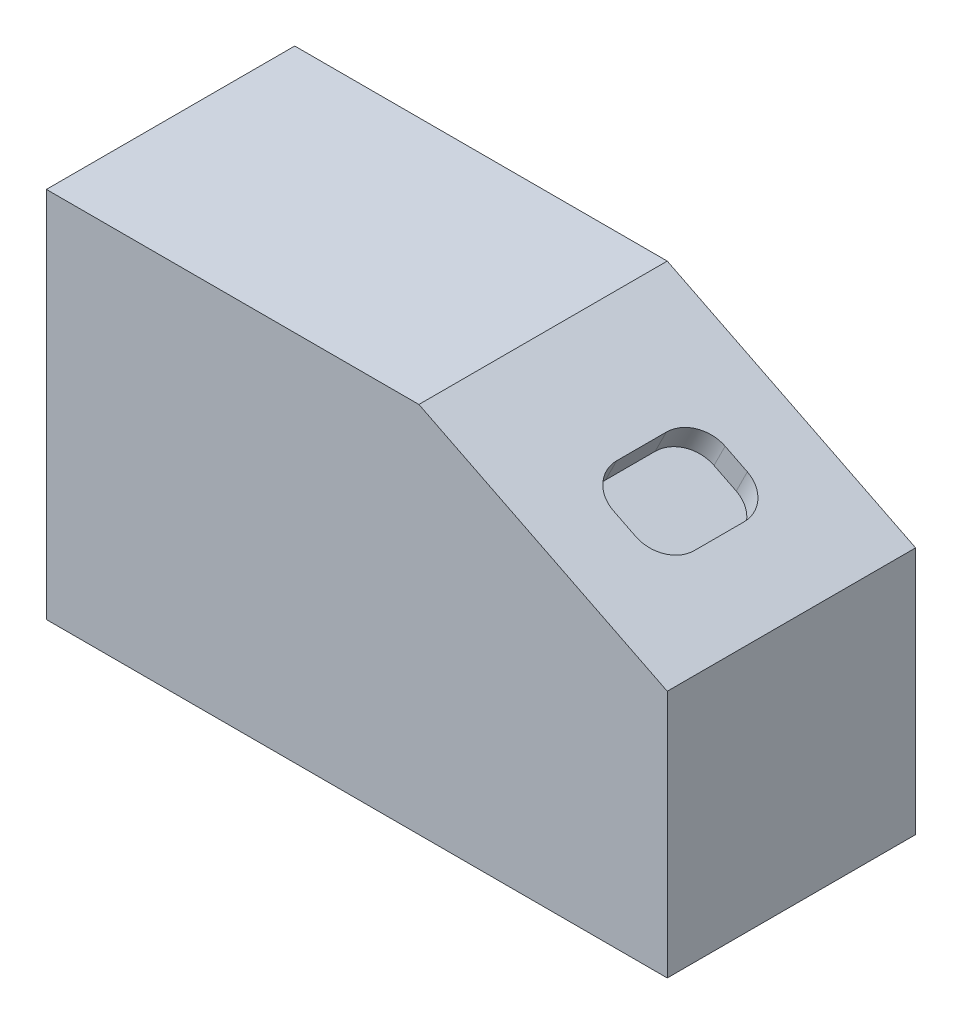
from build123d import *

# Parameters (mm, degrees)
SKETCH_1_W          = 100
SKETCH_1_H          = 60
EXTRUDE_1_DEPTH     = 40
CUT_EXTRUDE_1_DEPTH = 124.288280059
SKETCH_3_W          = 14
SKETCH_3_H          = 18
CUT_EXTRUDE_2_DEPTH = 4
FILLET_1_R          = 5


with BuildPart() as part:
    # Sketch 1 → Extrude 1 (new body)
    with BuildSketch(Plane.XY):
        with Locations((50, 30)):
            Rectangle(SKETCH_1_W, SKETCH_1_H)
    extrude(amount=-EXTRUDE_1_DEPTH)

    # Sketch 2 → Cut-Extrude 1 (cut, through all)
    with BuildSketch(Plane.XY):
        Polygon((100, 60), (100, 40), (60, 60), align=None)
    extrude(amount=-CUT_EXTRUDE_1_DEPTH, mode=Mode.SUBTRACT)

    # Sketch 3 → Cut-Extrude 2 (cut)
    with BuildSketch(Plane(origin=(36, 72, 0), x_dir=(0.894427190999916, -0.4472135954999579, 0), z_dir=(0.4472135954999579, 0.894427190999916, 0))):
        with Locations((51.55417528, 20)):
            Rectangle(SKETCH_3_W, SKETCH_3_H)
    extrude(amount=-CUT_EXTRUDE_2_DEPTH, mode=Mode.SUBTRACT)

    # Fillet 1
    fillet_1_edges = [part.edges().sort_by_distance(p)[0] for p in [
        (87.478019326, 44.024922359, -29),
        (87.478019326, 44.024922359, -11),
        (74.956038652, 50.285912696, -11),
        (74.956038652, 50.285912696, -29),
    ]]
    fillet(fillet_1_edges, radius=FILLET_1_R)


solid = part.part
